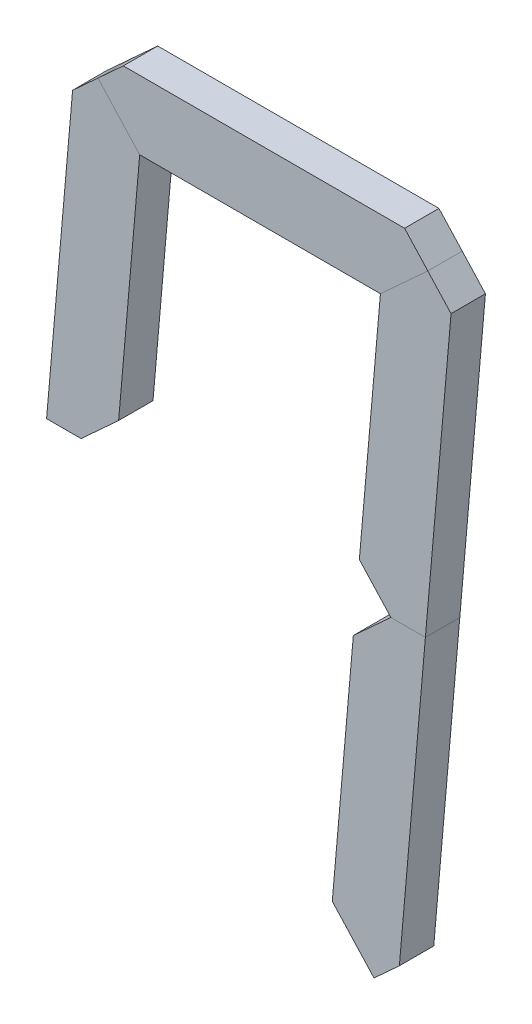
ISO-10303-21;
HEADER;
FILE_DESCRIPTION(('STEP AP214'),'2;1');
FILE_NAME('part.step','',(''),(''),'','','');
FILE_SCHEMA(('AUTOMOTIVE_DESIGN { 1 0 10303 214 1 1 1 1 }'));
ENDSEC;
DATA;
#1=APPLICATION_CONTEXT('core data for automotive mechanical design processes');
#2=APPLICATION_PROTOCOL_DEFINITION('international standard','automotive_design',2000,#1);
#3=PRODUCT_CONTEXT('',#1,'mechanical');
#4=PRODUCT('Part','Part','',(#3));
#5=PRODUCT_RELATED_PRODUCT_CATEGORY('part','',(#4));
#6=PRODUCT_DEFINITION_FORMATION('','',#4);
#7=PRODUCT_DEFINITION_CONTEXT('part definition',#1,'design');
#8=PRODUCT_DEFINITION('design','',#6,#7);
#9=PRODUCT_DEFINITION_SHAPE('','',#8);
#10=(LENGTH_UNIT() NAMED_UNIT(*) SI_UNIT(.MILLI.,.METRE.));
#11=(NAMED_UNIT(*) PLANE_ANGLE_UNIT() SI_UNIT($,.RADIAN.));
#12=(NAMED_UNIT(*) SI_UNIT($,.STERADIAN.) SOLID_ANGLE_UNIT());
#13=UNCERTAINTY_MEASURE_WITH_UNIT(LENGTH_MEASURE(1.E-05),#10,'distance_accuracy_value','');
#14=(GEOMETRIC_REPRESENTATION_CONTEXT(3) GLOBAL_UNCERTAINTY_ASSIGNED_CONTEXT((#13)) GLOBAL_UNIT_ASSIGNED_CONTEXT((#10,
#11,#12)) REPRESENTATION_CONTEXT('',''));
#15=CARTESIAN_POINT('',(0.,0.,0.));
#16=DIRECTION('',(0.,0.,1.));
#17=DIRECTION('',(1.,0.,0.));
#18=AXIS2_PLACEMENT_3D('',#15,#16,#17);
#19=CARTESIAN_POINT('',(2.78896464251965,4.63136133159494,0.));
#20=DIRECTION('',(-0.737277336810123,-0.675590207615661,0.));
#21=DIRECTION('',(0.675590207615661,-0.737277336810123,0.));
#22=AXIS2_PLACEMENT_3D('',#19,#20,#21);
#23=PLANE('',#22);
#24=DIRECTION('',(-0.675590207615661,0.737277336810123,0.));
#25=VECTOR('',#24,1.);
#26=CARTESIAN_POINT('',(2.78896464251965,4.63136133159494,-0.5));
#27=LINE('',#26,#25);
#28=CARTESIAN_POINT('',(2.78896464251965,4.63136133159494,-0.5));
#29=VERTEX_POINT('',#28);
#30=CARTESIAN_POINT('',(2.45116953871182,5.,-0.5));
#31=VERTEX_POINT('',#30);
#32=EDGE_CURVE('E134',#29,#31,#27,.T.);
#33=ORIENTED_EDGE('',*,*,#32,.T.);
#34=DIRECTION('',(0.,0.,-1.));
#35=VECTOR('',#34,1.);
#36=CARTESIAN_POINT('',(2.45116953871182,5.,0.));
#37=LINE('',#36,#35);
#38=CARTESIAN_POINT('',(2.45116953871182,5.,0.));
#39=VERTEX_POINT('',#38);
#40=EDGE_CURVE('E12',#39,#31,#37,.T.);
#41=ORIENTED_EDGE('',*,*,#40,.F.);
#42=DIRECTION('',(-0.675590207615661,0.737277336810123,0.));
#43=VECTOR('',#42,1.);
#44=CARTESIAN_POINT('',(2.78896464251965,4.63136133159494,0.));
#45=LINE('',#44,#43);
#46=CARTESIAN_POINT('',(2.78896464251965,4.63136133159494,0.));
#47=VERTEX_POINT('',#46);
#48=EDGE_CURVE('E144',#47,#39,#45,.T.);
#49=ORIENTED_EDGE('',*,*,#48,.F.);
#50=DIRECTION('',(0.,0.,-1.));
#51=VECTOR('',#50,1.);
#52=CARTESIAN_POINT('',(2.78896464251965,4.63136133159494,0.));
#53=LINE('',#52,#51);
#54=EDGE_CURVE('E130',#47,#29,#53,.T.);
#55=ORIENTED_EDGE('',*,*,#54,.T.);
#56=EDGE_LOOP('',(#33,#41,#49,#55));
#57=FACE_BOUND('',#56,.T.);
#58=ADVANCED_FACE('F50',(#57),#23,.F.);
#59=CARTESIAN_POINT('',(2.45116953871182,5.,0.));
#60=DIRECTION('',(0.,-1.,0.));
#61=DIRECTION('',(0.,0.,1.));
#62=AXIS2_PLACEMENT_3D('',#59,#60,#61);
#63=PLANE('',#62);
#64=DIRECTION('',(-1.,0.,0.));
#65=VECTOR('',#64,1.);
#66=CARTESIAN_POINT('',(2.45116953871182,5.,-0.5));
#67=LINE('',#66,#65);
#68=CARTESIAN_POINT('',(-1.63820566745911,5.,-0.5));
#69=VERTEX_POINT('',#68);
#70=EDGE_CURVE('E137',#31,#69,#67,.T.);
#71=ORIENTED_EDGE('',*,*,#70,.T.);
#72=DIRECTION('',(0.,0.,-1.));
#73=VECTOR('',#72,1.);
#74=CARTESIAN_POINT('',(-1.63820566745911,5.,0.));
#75=LINE('',#74,#73);
#76=CARTESIAN_POINT('',(-1.63820566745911,5.,0.));
#77=VERTEX_POINT('',#76);
#78=EDGE_CURVE('E58',#77,#69,#75,.T.);
#79=ORIENTED_EDGE('',*,*,#78,.F.);
#80=DIRECTION('',(-1.,0.,0.));
#81=VECTOR('',#80,1.);
#82=CARTESIAN_POINT('',(2.45116953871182,5.,0.));
#83=LINE('',#82,#81);
#84=EDGE_CURVE('E103',#39,#77,#83,.T.);
#85=ORIENTED_EDGE('',*,*,#84,.F.);
#86=ORIENTED_EDGE('',*,*,#40,.T.);
#87=EDGE_LOOP('',(#71,#79,#85,#86));
#88=FACE_BOUND('',#87,.T.);
#89=ADVANCED_FACE('F168',(#88),#63,.F.);
#90=CARTESIAN_POINT('',(-1.63820566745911,5.,0.));
#91=DIRECTION('',(0.675590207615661,-0.737277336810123,0.));
#92=DIRECTION('',(0.737277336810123,0.675590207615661,0.));
#93=AXIS2_PLACEMENT_3D('',#90,#91,#92);
#94=PLANE('',#93);
#95=DIRECTION('',(-0.737277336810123,-0.675590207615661,0.));
#96=VECTOR('',#95,1.);
#97=CARTESIAN_POINT('',(-1.63820566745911,5.,-0.5));
#98=LINE('',#97,#96);
#99=CARTESIAN_POINT('',(-2.00684433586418,4.66220489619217,-0.5));
#100=VERTEX_POINT('',#99);
#101=EDGE_CURVE('E139',#69,#100,#98,.T.);
#102=ORIENTED_EDGE('',*,*,#101,.T.);
#103=DIRECTION('',(0.,0.,-1.));
#104=VECTOR('',#103,1.);
#105=CARTESIAN_POINT('',(-2.00684433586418,4.66220489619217,0.));
#106=LINE('',#105,#104);
#107=CARTESIAN_POINT('',(-2.00684433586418,4.66220489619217,0.));
#108=VERTEX_POINT('',#107);
#109=EDGE_CURVE('E125',#108,#100,#106,.T.);
#110=ORIENTED_EDGE('',*,*,#109,.F.);
#111=DIRECTION('',(-0.737277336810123,-0.675590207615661,0.));
#112=VECTOR('',#111,1.);
#113=CARTESIAN_POINT('',(-1.63820566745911,5.,0.));
#114=LINE('',#113,#112);
#115=EDGE_CURVE('E116',#77,#108,#114,.T.);
#116=ORIENTED_EDGE('',*,*,#115,.F.);
#117=ORIENTED_EDGE('',*,*,#78,.T.);
#118=EDGE_LOOP('',(#102,#110,#116,#117));
#119=FACE_BOUND('',#118,.T.);
#120=ADVANCED_FACE('F150',(#119),#94,.F.);
#121=CARTESIAN_POINT('',(-2.00684433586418,4.66220489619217,0.));
#122=DIRECTION('',(0.737277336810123,0.675590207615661,0.));
#123=DIRECTION('',(-0.675590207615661,0.737277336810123,0.));
#124=AXIS2_PLACEMENT_3D('',#121,#122,#123);
#125=PLANE('',#124);
#126=DIRECTION('',(0.675590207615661,-0.737277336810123,0.));
#127=VECTOR('',#126,1.);
#128=CARTESIAN_POINT('',(-2.00684433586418,4.66220489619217,-0.5));
#129=LINE('',#128,#127);
#130=CARTESIAN_POINT('',(-1.40004534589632,4.,-0.5));
#131=VERTEX_POINT('',#130);
#132=EDGE_CURVE('E124',#100,#131,#129,.T.);
#133=ORIENTED_EDGE('',*,*,#132,.T.);
#134=DIRECTION('',(0.,0.,-1.));
#135=VECTOR('',#134,1.);
#136=CARTESIAN_POINT('',(-1.40004534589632,4.,0.));
#137=LINE('',#136,#135);
#138=CARTESIAN_POINT('',(-1.40004534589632,4.,0.));
#139=VERTEX_POINT('',#138);
#140=EDGE_CURVE('E121',#139,#131,#137,.T.);
#141=ORIENTED_EDGE('',*,*,#140,.F.);
#142=DIRECTION('',(0.675590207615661,-0.737277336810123,0.));
#143=VECTOR('',#142,1.);
#144=CARTESIAN_POINT('',(-2.00684433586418,4.66220489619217,0.));
#145=LINE('',#144,#143);
#146=EDGE_CURVE('E110',#108,#139,#145,.T.);
#147=ORIENTED_EDGE('',*,*,#146,.F.);
#148=ORIENTED_EDGE('',*,*,#109,.T.);
#149=EDGE_LOOP('',(#133,#141,#147,#148));
#150=FACE_BOUND('',#149,.T.);
#151=ADVANCED_FACE('F122',(#150),#125,.F.);
#152=CARTESIAN_POINT('',(-1.40004534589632,4.,0.));
#153=DIRECTION('',(0.,1.,0.));
#154=DIRECTION('',(0.,0.,-1.));
#155=AXIS2_PLACEMENT_3D('',#152,#153,#154);
#156=PLANE('',#155);
#157=DIRECTION('',(1.,0.,0.));
#158=VECTOR('',#157,1.);
#159=CARTESIAN_POINT('',(-1.40004534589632,4.,-0.5));
#160=LINE('',#159,#158);
#161=CARTESIAN_POINT('',(2.09995465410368,4.,-0.5));
#162=VERTEX_POINT('',#161);
#163=EDGE_CURVE('E89',#131,#162,#160,.T.);
#164=ORIENTED_EDGE('',*,*,#163,.T.);
#165=DIRECTION('',(0.,0.,-1.));
#166=VECTOR('',#165,1.);
#167=CARTESIAN_POINT('',(2.09995465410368,4.,0.));
#168=LINE('',#167,#166);
#169=CARTESIAN_POINT('',(2.09995465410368,4.,0.));
#170=VERTEX_POINT('',#169);
#171=EDGE_CURVE('E126',#170,#162,#168,.T.);
#172=ORIENTED_EDGE('',*,*,#171,.F.);
#173=DIRECTION('',(1.,0.,0.));
#174=VECTOR('',#173,1.);
#175=CARTESIAN_POINT('',(-1.40004534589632,4.,0.));
#176=LINE('',#175,#174);
#177=EDGE_CURVE('E114',#139,#170,#176,.T.);
#178=ORIENTED_EDGE('',*,*,#177,.F.);
#179=ORIENTED_EDGE('',*,*,#140,.T.);
#180=EDGE_LOOP('',(#164,#172,#178,#179));
#181=FACE_BOUND('',#180,.T.);
#182=ADVANCED_FACE('F128',(#181),#156,.F.);
#183=CARTESIAN_POINT('',(2.09995465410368,4.,0.));
#184=DIRECTION('',(-0.675590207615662,0.737277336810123,0.));
#185=DIRECTION('',(-0.737277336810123,-0.675590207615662,0.));
#186=AXIS2_PLACEMENT_3D('',#183,#184,#185);
#187=PLANE('',#186);
#188=DIRECTION('',(0.737277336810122,0.675590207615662,0.));
#189=VECTOR('',#188,1.);
#190=CARTESIAN_POINT('',(2.09995465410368,4.,-0.5));
#191=LINE('',#190,#189);
#192=EDGE_CURVE('E95',#162,#29,#191,.T.);
#193=ORIENTED_EDGE('',*,*,#192,.T.);
#194=ORIENTED_EDGE('',*,*,#54,.F.);
#195=DIRECTION('',(0.737277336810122,0.675590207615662,0.));
#196=VECTOR('',#195,1.);
#197=CARTESIAN_POINT('',(2.09995465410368,4.,0.));
#198=LINE('',#197,#196);
#199=EDGE_CURVE('E66',#170,#47,#198,.T.);
#200=ORIENTED_EDGE('',*,*,#199,.F.);
#201=ORIENTED_EDGE('',*,*,#171,.T.);
#202=EDGE_LOOP('',(#193,#194,#200,#201));
#203=FACE_BOUND('',#202,.T.);
#204=ADVANCED_FACE('F157',(#203),#187,.F.);
#205=CARTESIAN_POINT('',(0.,0.,0.));
#206=DIRECTION('',(0.,0.,1.));
#207=DIRECTION('',(-1.,0.,0.));
#208=AXIS2_PLACEMENT_3D('',#205,#206,#207);
#209=PLANE('',#208);
#210=ORIENTED_EDGE('',*,*,#48,.T.);
#211=ORIENTED_EDGE('',*,*,#84,.T.);
#212=ORIENTED_EDGE('',*,*,#115,.T.);
#213=ORIENTED_EDGE('',*,*,#146,.T.);
#214=ORIENTED_EDGE('',*,*,#177,.T.);
#215=ORIENTED_EDGE('',*,*,#199,.T.);
#216=EDGE_LOOP('',(#210,#211,#212,#213,#214,#215));
#217=FACE_BOUND('',#216,.T.);
#218=ADVANCED_FACE('F112',(#217),#209,.T.);
#219=CARTESIAN_POINT('',(0.,0.,-0.5));
#220=DIRECTION('',(0.,0.,1.));
#221=DIRECTION('',(-1.,0.,0.));
#222=AXIS2_PLACEMENT_3D('',#219,#220,#221);
#223=PLANE('',#222);
#224=ORIENTED_EDGE('',*,*,#32,.F.);
#225=ORIENTED_EDGE('',*,*,#192,.F.);
#226=ORIENTED_EDGE('',*,*,#163,.F.);
#227=ORIENTED_EDGE('',*,*,#132,.F.);
#228=ORIENTED_EDGE('',*,*,#101,.F.);
#229=ORIENTED_EDGE('',*,*,#70,.F.);
#230=EDGE_LOOP('',(#224,#225,#226,#227,#228,#229));
#231=FACE_BOUND('',#230,.T.);
#232=ADVANCED_FACE('F153',(#231),#223,.F.);
#233=CLOSED_SHELL('',(#58,#89,#120,#151,#182,#204,#218,#232));
#234=MANIFOLD_SOLID_BREP('B2',#233);
#235=CARTESIAN_POINT('',(2.78896464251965,4.63136133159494,0.));
#236=DIRECTION('',(-0.737277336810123,-0.675590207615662,0.));
#237=DIRECTION('',(0.675590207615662,-0.737277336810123,0.));
#238=AXIS2_PLACEMENT_3D('',#235,#236,#237);
#239=PLANE('',#238);
#240=DIRECTION('',(-0.675590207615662,0.737277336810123,0.));
#241=VECTOR('',#240,1.);
#242=CARTESIAN_POINT('',(2.78896464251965,4.63136133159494,-0.5));
#243=LINE('',#242,#241);
#244=CARTESIAN_POINT('',(3.12675974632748,4.26272266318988,-0.5));
#245=VERTEX_POINT('',#244);
#246=CARTESIAN_POINT('',(2.78896464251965,4.63136133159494,-0.5));
#247=VERTEX_POINT('',#246);
#248=EDGE_CURVE('E320',#245,#247,#243,.T.);
#249=ORIENTED_EDGE('',*,*,#248,.T.);
#250=DIRECTION('',(0.,0.,-1.));
#251=VECTOR('',#250,1.);
#252=CARTESIAN_POINT('',(2.78896464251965,4.63136133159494,0.));
#253=LINE('',#252,#251);
#254=CARTESIAN_POINT('',(2.78896464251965,4.63136133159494,0.));
#255=VERTEX_POINT('',#254);
#256=EDGE_CURVE('E48',#255,#247,#253,.T.);
#257=ORIENTED_EDGE('',*,*,#256,.F.);
#258=DIRECTION('',(-0.675590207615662,0.737277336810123,0.));
#259=VECTOR('',#258,1.);
#260=CARTESIAN_POINT('',(2.78896464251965,4.63136133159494,0.));
#261=LINE('',#260,#259);
#262=CARTESIAN_POINT('',(3.12675974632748,4.26272266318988,0.));
#263=VERTEX_POINT('',#262);
#264=EDGE_CURVE('E330',#263,#255,#261,.T.);
#265=ORIENTED_EDGE('',*,*,#264,.F.);
#266=DIRECTION('',(0.,0.,-1.));
#267=VECTOR('',#266,1.);
#268=CARTESIAN_POINT('',(3.12675974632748,4.26272266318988,0.));
#269=LINE('',#268,#267);
#270=EDGE_CURVE('E316',#263,#245,#269,.T.);
#271=ORIENTED_EDGE('',*,*,#270,.T.);
#272=EDGE_LOOP('',(#249,#257,#265,#271));
#273=FACE_BOUND('',#272,.T.);
#274=ADVANCED_FACE('F236',(#273),#239,.F.);
#275=CARTESIAN_POINT('',(2.09995465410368,4.,0.));
#276=DIRECTION('',(0.675590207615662,-0.737277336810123,0.));
#277=DIRECTION('',(0.737277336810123,0.675590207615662,0.));
#278=AXIS2_PLACEMENT_3D('',#275,#276,#277);
#279=PLANE('',#278);
#280=DIRECTION('',(-0.737277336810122,-0.675590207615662,0.));
#281=VECTOR('',#280,1.);
#282=CARTESIAN_POINT('',(2.09995465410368,4.,-0.5));
#283=LINE('',#282,#281);
#284=CARTESIAN_POINT('',(2.09995465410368,4.,-0.5));
#285=VERTEX_POINT('',#284);
#286=EDGE_CURVE('E323',#247,#285,#283,.T.);
#287=ORIENTED_EDGE('',*,*,#286,.T.);
#288=DIRECTION('',(0.,0.,-1.));
#289=VECTOR('',#288,1.);
#290=CARTESIAN_POINT('',(2.09995465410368,4.,0.));
#291=LINE('',#290,#289);
#292=CARTESIAN_POINT('',(2.09995465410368,4.,0.));
#293=VERTEX_POINT('',#292);
#294=EDGE_CURVE('E244',#293,#285,#291,.T.);
#295=ORIENTED_EDGE('',*,*,#294,.F.);
#296=DIRECTION('',(-0.737277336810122,-0.675590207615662,0.));
#297=VECTOR('',#296,1.);
#298=CARTESIAN_POINT('',(2.09995465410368,4.,0.));
#299=LINE('',#298,#297);
#300=EDGE_CURVE('E289',#255,#293,#299,.T.);
#301=ORIENTED_EDGE('',*,*,#300,.F.);
#302=ORIENTED_EDGE('',*,*,#256,.T.);
#303=EDGE_LOOP('',(#287,#295,#301,#302));
#304=FACE_BOUND('',#303,.T.);
#305=ADVANCED_FACE('F354',(#304),#279,.F.);
#306=CARTESIAN_POINT('',(1.79374433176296,0.499999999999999,0.));
#307=DIRECTION('',(0.996194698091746,-0.0871557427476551,0.));
#308=DIRECTION('',(0.0871557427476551,0.996194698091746,0.));
#309=AXIS2_PLACEMENT_3D('',#306,#307,#308);
#310=PLANE('',#309);
#311=DIRECTION('',(-0.0871557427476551,-0.996194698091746,0.));
#312=VECTOR('',#311,1.);
#313=CARTESIAN_POINT('',(1.79374433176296,0.499999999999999,-0.5));
#314=LINE('',#313,#312);
#315=CARTESIAN_POINT('',(1.79374433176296,0.499999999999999,-0.5));
#316=VERTEX_POINT('',#315);
#317=EDGE_CURVE('E325',#285,#316,#314,.T.);
#318=ORIENTED_EDGE('',*,*,#317,.T.);
#319=DIRECTION('',(0.,0.,-1.));
#320=VECTOR('',#319,1.);
#321=CARTESIAN_POINT('',(1.79374433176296,0.499999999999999,0.));
#322=LINE('',#321,#320);
#323=CARTESIAN_POINT('',(1.79374433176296,0.499999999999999,0.));
#324=VERTEX_POINT('',#323);
#325=EDGE_CURVE('E311',#324,#316,#322,.T.);
#326=ORIENTED_EDGE('',*,*,#325,.F.);
#327=DIRECTION('',(-0.0871557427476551,-0.996194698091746,0.));
#328=VECTOR('',#327,1.);
#329=CARTESIAN_POINT('',(1.79374433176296,0.499999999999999,0.));
#330=LINE('',#329,#328);
#331=EDGE_CURVE('E302',#293,#324,#330,.T.);
#332=ORIENTED_EDGE('',*,*,#331,.F.);
#333=ORIENTED_EDGE('',*,*,#294,.T.);
#334=EDGE_LOOP('',(#318,#326,#332,#333));
#335=FACE_BOUND('',#334,.T.);
#336=ADVANCED_FACE('F336',(#335),#310,.F.);
#337=CARTESIAN_POINT('',(2.25190991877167,0.,0.));
#338=DIRECTION('',(0.737277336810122,0.675590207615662,0.));
#339=DIRECTION('',(-0.675590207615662,0.737277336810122,0.));
#340=AXIS2_PLACEMENT_3D('',#337,#338,#339);
#341=PLANE('',#340);
#342=DIRECTION('',(0.675590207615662,-0.737277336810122,0.));
#343=VECTOR('',#342,1.);
#344=CARTESIAN_POINT('',(2.25190991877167,0.,-0.5));
#345=LINE('',#344,#343);
#346=CARTESIAN_POINT('',(2.25190991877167,0.,-0.5));
#347=VERTEX_POINT('',#346);
#348=EDGE_CURVE('E310',#316,#347,#345,.T.);
#349=ORIENTED_EDGE('',*,*,#348,.T.);
#350=DIRECTION('',(0.,0.,-1.));
#351=VECTOR('',#350,1.);
#352=CARTESIAN_POINT('',(2.25190991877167,0.,0.));
#353=LINE('',#352,#351);
#354=CARTESIAN_POINT('',(2.25190991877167,0.,0.));
#355=VERTEX_POINT('',#354);
#356=EDGE_CURVE('E307',#355,#347,#353,.T.);
#357=ORIENTED_EDGE('',*,*,#356,.F.);
#358=DIRECTION('',(0.675590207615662,-0.737277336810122,0.));
#359=VECTOR('',#358,1.);
#360=CARTESIAN_POINT('',(2.25190991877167,0.,0.));
#361=LINE('',#360,#359);
#362=EDGE_CURVE('E296',#324,#355,#361,.T.);
#363=ORIENTED_EDGE('',*,*,#362,.F.);
#364=ORIENTED_EDGE('',*,*,#325,.T.);
#365=EDGE_LOOP('',(#349,#357,#363,#364));
#366=FACE_BOUND('',#365,.T.);
#367=ADVANCED_FACE('F308',(#366),#341,.F.);
#368=CARTESIAN_POINT('',(2.75381983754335,0.,0.));
#369=DIRECTION('',(0.,1.,0.));
#370=DIRECTION('',(-1.,0.,0.));
#371=AXIS2_PLACEMENT_3D('',#368,#369,#370);
#372=PLANE('',#371);
#373=DIRECTION('',(1.,0.,0.));
#374=VECTOR('',#373,1.);
#375=CARTESIAN_POINT('',(2.75381983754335,0.,-0.5));
#376=LINE('',#375,#374);
#377=CARTESIAN_POINT('',(2.75381983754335,0.,-0.5));
#378=VERTEX_POINT('',#377);
#379=EDGE_CURVE('E275',#347,#378,#376,.T.);
#380=ORIENTED_EDGE('',*,*,#379,.T.);
#381=DIRECTION('',(0.,0.,-1.));
#382=VECTOR('',#381,1.);
#383=CARTESIAN_POINT('',(2.75381983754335,0.,0.));
#384=LINE('',#383,#382);
#385=CARTESIAN_POINT('',(2.75381983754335,0.,0.));
#386=VERTEX_POINT('',#385);
#387=EDGE_CURVE('E312',#386,#378,#384,.T.);
#388=ORIENTED_EDGE('',*,*,#387,.F.);
#389=DIRECTION('',(1.,0.,0.));
#390=VECTOR('',#389,1.);
#391=CARTESIAN_POINT('',(2.75381983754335,0.,0.));
#392=LINE('',#391,#390);
#393=EDGE_CURVE('E300',#355,#386,#392,.T.);
#394=ORIENTED_EDGE('',*,*,#393,.F.);
#395=ORIENTED_EDGE('',*,*,#356,.T.);
#396=EDGE_LOOP('',(#380,#388,#394,#395));
#397=FACE_BOUND('',#396,.T.);
#398=ADVANCED_FACE('F314',(#397),#372,.F.);
#399=CARTESIAN_POINT('',(3.12675974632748,4.26272266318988,0.));
#400=DIRECTION('',(-0.996194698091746,0.0871557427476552,0.));
#401=DIRECTION('',(-0.0871557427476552,-0.996194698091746,0.));
#402=AXIS2_PLACEMENT_3D('',#399,#400,#401);
#403=PLANE('',#402);
#404=DIRECTION('',(0.0871557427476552,0.996194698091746,0.));
#405=VECTOR('',#404,1.);
#406=CARTESIAN_POINT('',(3.12675974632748,4.26272266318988,-0.5));
#407=LINE('',#406,#405);
#408=EDGE_CURVE('E281',#378,#245,#407,.T.);
#409=ORIENTED_EDGE('',*,*,#408,.T.);
#410=ORIENTED_EDGE('',*,*,#270,.F.);
#411=DIRECTION('',(0.0871557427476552,0.996194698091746,0.));
#412=VECTOR('',#411,1.);
#413=CARTESIAN_POINT('',(3.12675974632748,4.26272266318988,0.));
#414=LINE('',#413,#412);
#415=EDGE_CURVE('E252',#386,#263,#414,.T.);
#416=ORIENTED_EDGE('',*,*,#415,.F.);
#417=ORIENTED_EDGE('',*,*,#387,.T.);
#418=EDGE_LOOP('',(#409,#410,#416,#417));
#419=FACE_BOUND('',#418,.T.);
#420=ADVANCED_FACE('F343',(#419),#403,.F.);
#421=CARTESIAN_POINT('',(0.,0.,0.));
#422=DIRECTION('',(0.,0.,1.));
#423=DIRECTION('',(-1.,0.,0.));
#424=AXIS2_PLACEMENT_3D('',#421,#422,#423);
#425=PLANE('',#424);
#426=ORIENTED_EDGE('',*,*,#264,.T.);
#427=ORIENTED_EDGE('',*,*,#300,.T.);
#428=ORIENTED_EDGE('',*,*,#331,.T.);
#429=ORIENTED_EDGE('',*,*,#362,.T.);
#430=ORIENTED_EDGE('',*,*,#393,.T.);
#431=ORIENTED_EDGE('',*,*,#415,.T.);
#432=EDGE_LOOP('',(#426,#427,#428,#429,#430,#431));
#433=FACE_BOUND('',#432,.T.);
#434=ADVANCED_FACE('F298',(#433),#425,.T.);
#435=CARTESIAN_POINT('',(0.,0.,-0.5));
#436=DIRECTION('',(0.,0.,1.));
#437=DIRECTION('',(-1.,0.,0.));
#438=AXIS2_PLACEMENT_3D('',#435,#436,#437);
#439=PLANE('',#438);
#440=ORIENTED_EDGE('',*,*,#248,.F.);
#441=ORIENTED_EDGE('',*,*,#408,.F.);
#442=ORIENTED_EDGE('',*,*,#379,.F.);
#443=ORIENTED_EDGE('',*,*,#348,.F.);
#444=ORIENTED_EDGE('',*,*,#317,.F.);
#445=ORIENTED_EDGE('',*,*,#286,.F.);
#446=EDGE_LOOP('',(#440,#441,#442,#443,#444,#445));
#447=FACE_BOUND('',#446,.T.);
#448=ADVANCED_FACE('F339',(#447),#439,.F.);
#449=CLOSED_SHELL('',(#274,#305,#336,#367,#398,#420,#434,#448));
#450=MANIFOLD_SOLID_BREP('B6',#449);
#451=CARTESIAN_POINT('',(-2.00684433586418,4.66220489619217,0.));
#452=DIRECTION('',(-0.737277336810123,-0.675590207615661,0.));
#453=DIRECTION('',(0.675590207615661,-0.737277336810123,0.));
#454=AXIS2_PLACEMENT_3D('',#451,#452,#453);
#455=PLANE('',#454);
#456=DIRECTION('',(-0.675590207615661,0.737277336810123,0.));
#457=VECTOR('',#456,1.);
#458=CARTESIAN_POINT('',(-2.00684433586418,4.66220489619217,-0.5));
#459=LINE('',#458,#457);
#460=CARTESIAN_POINT('',(-1.40004534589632,4.,-0.5));
#461=VERTEX_POINT('',#460);
#462=CARTESIAN_POINT('',(-2.00684433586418,4.66220489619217,-0.5));
#463=VERTEX_POINT('',#462);
#464=EDGE_CURVE('E505',#461,#463,#459,.T.);
#465=ORIENTED_EDGE('',*,*,#464,.T.);
#466=DIRECTION('',(0.,0.,-1.));
#467=VECTOR('',#466,1.);
#468=CARTESIAN_POINT('',(-2.00684433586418,4.66220489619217,0.));
#469=LINE('',#468,#467);
#470=CARTESIAN_POINT('',(-2.00684433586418,4.66220489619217,0.));
#471=VERTEX_POINT('',#470);
#472=EDGE_CURVE('E234',#471,#463,#469,.T.);
#473=ORIENTED_EDGE('',*,*,#472,.F.);
#474=DIRECTION('',(-0.675590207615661,0.737277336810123,0.));
#475=VECTOR('',#474,1.);
#476=CARTESIAN_POINT('',(-2.00684433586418,4.66220489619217,0.));
#477=LINE('',#476,#475);
#478=CARTESIAN_POINT('',(-1.40004534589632,4.,0.));
#479=VERTEX_POINT('',#478);
#480=EDGE_CURVE('E515',#479,#471,#477,.T.);
#481=ORIENTED_EDGE('',*,*,#480,.F.);
#482=DIRECTION('',(0.,0.,-1.));
#483=VECTOR('',#482,1.);
#484=CARTESIAN_POINT('',(-1.40004534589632,4.,0.));
#485=LINE('',#484,#483);
#486=EDGE_CURVE('E501',#479,#461,#485,.T.);
#487=ORIENTED_EDGE('',*,*,#486,.T.);
#488=EDGE_LOOP('',(#465,#473,#481,#487));
#489=FACE_BOUND('',#488,.T.);
#490=ADVANCED_FACE('F421',(#489),#455,.F.);
#491=CARTESIAN_POINT('',(-2.37548300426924,4.32440979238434,0.));
#492=DIRECTION('',(0.675590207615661,-0.737277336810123,0.));
#493=DIRECTION('',(0.737277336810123,0.675590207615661,0.));
#494=AXIS2_PLACEMENT_3D('',#491,#492,#493);
#495=PLANE('',#494);
#496=DIRECTION('',(-0.737277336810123,-0.675590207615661,0.));
#497=VECTOR('',#496,1.);
#498=CARTESIAN_POINT('',(-2.37548300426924,4.32440979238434,-0.5));
#499=LINE('',#498,#497);
#500=CARTESIAN_POINT('',(-2.37548300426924,4.32440979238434,-0.5));
#501=VERTEX_POINT('',#500);
#502=EDGE_CURVE('E508',#463,#501,#499,.T.);
#503=ORIENTED_EDGE('',*,*,#502,.T.);
#504=DIRECTION('',(0.,0.,-1.));
#505=VECTOR('',#504,1.);
#506=CARTESIAN_POINT('',(-2.37548300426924,4.32440979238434,0.));
#507=LINE('',#506,#505);
#508=CARTESIAN_POINT('',(-2.37548300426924,4.32440979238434,0.));
#509=VERTEX_POINT('',#508);
#510=EDGE_CURVE('E429',#509,#501,#507,.T.);
#511=ORIENTED_EDGE('',*,*,#510,.F.);
#512=DIRECTION('',(-0.737277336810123,-0.675590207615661,0.));
#513=VECTOR('',#512,1.);
#514=CARTESIAN_POINT('',(-2.37548300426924,4.32440979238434,0.));
#515=LINE('',#514,#513);
#516=EDGE_CURVE('E474',#471,#509,#515,.T.);
#517=ORIENTED_EDGE('',*,*,#516,.F.);
#518=ORIENTED_EDGE('',*,*,#472,.T.);
#519=EDGE_LOOP('',(#503,#511,#517,#518));
#520=FACE_BOUND('',#519,.T.);
#521=ADVANCED_FACE('F539',(#520),#495,.F.);
#522=CARTESIAN_POINT('',(-2.75381983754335,0.,0.));
#523=DIRECTION('',(0.996194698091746,-0.087155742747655,0.));
#524=DIRECTION('',(0.087155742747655,0.996194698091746,0.));
#525=AXIS2_PLACEMENT_3D('',#522,#523,#524);
#526=PLANE('',#525);
#527=DIRECTION('',(-0.087155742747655,-0.996194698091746,0.));
#528=VECTOR('',#527,1.);
#529=CARTESIAN_POINT('',(-2.75381983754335,0.,-0.5));
#530=LINE('',#529,#528);
#531=CARTESIAN_POINT('',(-2.75381983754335,0.,-0.5));
#532=VERTEX_POINT('',#531);
#533=EDGE_CURVE('E510',#501,#532,#530,.T.);
#534=ORIENTED_EDGE('',*,*,#533,.T.);
#535=DIRECTION('',(0.,0.,-1.));
#536=VECTOR('',#535,1.);
#537=CARTESIAN_POINT('',(-2.75381983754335,0.,0.));
#538=LINE('',#537,#536);
#539=CARTESIAN_POINT('',(-2.75381983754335,0.,0.));
#540=VERTEX_POINT('',#539);
#541=EDGE_CURVE('E496',#540,#532,#538,.T.);
#542=ORIENTED_EDGE('',*,*,#541,.F.);
#543=DIRECTION('',(-0.087155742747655,-0.996194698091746,0.));
#544=VECTOR('',#543,1.);
#545=CARTESIAN_POINT('',(-2.75381983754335,0.,0.));
#546=LINE('',#545,#544);
#547=EDGE_CURVE('E487',#509,#540,#546,.T.);
#548=ORIENTED_EDGE('',*,*,#547,.F.);
#549=ORIENTED_EDGE('',*,*,#510,.T.);
#550=EDGE_LOOP('',(#534,#542,#548,#549));
#551=FACE_BOUND('',#550,.T.);
#552=ADVANCED_FACE('F521',(#551),#526,.F.);
#553=CARTESIAN_POINT('',(-2.25190991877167,0.,0.));
#554=DIRECTION('',(0.,1.,0.));
#555=DIRECTION('',(-1.,0.,0.));
#556=AXIS2_PLACEMENT_3D('',#553,#554,#555);
#557=PLANE('',#556);
#558=DIRECTION('',(1.,0.,0.));
#559=VECTOR('',#558,1.);
#560=CARTESIAN_POINT('',(-2.25190991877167,0.,-0.5));
#561=LINE('',#560,#559);
#562=CARTESIAN_POINT('',(-2.25190991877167,0.,-0.5));
#563=VERTEX_POINT('',#562);
#564=EDGE_CURVE('E495',#532,#563,#561,.T.);
#565=ORIENTED_EDGE('',*,*,#564,.T.);
#566=DIRECTION('',(0.,0.,-1.));
#567=VECTOR('',#566,1.);
#568=CARTESIAN_POINT('',(-2.25190991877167,0.,0.));
#569=LINE('',#568,#567);
#570=CARTESIAN_POINT('',(-2.25190991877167,0.,0.));
#571=VERTEX_POINT('',#570);
#572=EDGE_CURVE('E492',#571,#563,#569,.T.);
#573=ORIENTED_EDGE('',*,*,#572,.F.);
#574=DIRECTION('',(1.,0.,0.));
#575=VECTOR('',#574,1.);
#576=CARTESIAN_POINT('',(-2.25190991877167,0.,0.));
#577=LINE('',#576,#575);
#578=EDGE_CURVE('E481',#540,#571,#577,.T.);
#579=ORIENTED_EDGE('',*,*,#578,.F.);
#580=ORIENTED_EDGE('',*,*,#541,.T.);
#581=EDGE_LOOP('',(#565,#573,#579,#580));
#582=FACE_BOUND('',#581,.T.);
#583=ADVANCED_FACE('F493',(#582),#557,.F.);
#584=CARTESIAN_POINT('',(-1.70625566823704,0.499999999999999,0.));
#585=DIRECTION('',(-0.675590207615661,0.737277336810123,0.));
#586=DIRECTION('',(-0.737277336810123,-0.675590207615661,0.));
#587=AXIS2_PLACEMENT_3D('',#584,#585,#586);
#588=PLANE('',#587);
#589=DIRECTION('',(0.737277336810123,0.675590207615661,0.));
#590=VECTOR('',#589,1.);
#591=CARTESIAN_POINT('',(-1.70625566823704,0.499999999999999,-0.5));
#592=LINE('',#591,#590);
#593=CARTESIAN_POINT('',(-1.70625566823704,0.499999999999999,-0.5));
#594=VERTEX_POINT('',#593);
#595=EDGE_CURVE('E460',#563,#594,#592,.T.);
#596=ORIENTED_EDGE('',*,*,#595,.T.);
#597=DIRECTION('',(0.,0.,-1.));
#598=VECTOR('',#597,1.);
#599=CARTESIAN_POINT('',(-1.70625566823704,0.499999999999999,0.));
#600=LINE('',#599,#598);
#601=CARTESIAN_POINT('',(-1.70625566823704,0.499999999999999,0.));
#602=VERTEX_POINT('',#601);
#603=EDGE_CURVE('E497',#602,#594,#600,.T.);
#604=ORIENTED_EDGE('',*,*,#603,.F.);
#605=DIRECTION('',(0.737277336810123,0.675590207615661,0.));
#606=VECTOR('',#605,1.);
#607=CARTESIAN_POINT('',(-1.70625566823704,0.499999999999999,0.));
#608=LINE('',#607,#606);
#609=EDGE_CURVE('E485',#571,#602,#608,.T.);
#610=ORIENTED_EDGE('',*,*,#609,.F.);
#611=ORIENTED_EDGE('',*,*,#572,.T.);
#612=EDGE_LOOP('',(#596,#604,#610,#611));
#613=FACE_BOUND('',#612,.T.);
#614=ADVANCED_FACE('F499',(#613),#588,.F.);
#615=CARTESIAN_POINT('',(-1.40004534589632,4.,0.));
#616=DIRECTION('',(-0.996194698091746,0.0871557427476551,0.));
#617=DIRECTION('',(-0.0871557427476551,-0.996194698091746,0.));
#618=AXIS2_PLACEMENT_3D('',#615,#616,#617);
#619=PLANE('',#618);
#620=DIRECTION('',(0.0871557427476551,0.996194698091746,0.));
#621=VECTOR('',#620,1.);
#622=CARTESIAN_POINT('',(-1.40004534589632,4.,-0.5));
#623=LINE('',#622,#621);
#624=EDGE_CURVE('E466',#594,#461,#623,.T.);
#625=ORIENTED_EDGE('',*,*,#624,.T.);
#626=ORIENTED_EDGE('',*,*,#486,.F.);
#627=DIRECTION('',(0.0871557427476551,0.996194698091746,0.));
#628=VECTOR('',#627,1.);
#629=CARTESIAN_POINT('',(-1.40004534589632,4.,0.));
#630=LINE('',#629,#628);
#631=EDGE_CURVE('E437',#602,#479,#630,.T.);
#632=ORIENTED_EDGE('',*,*,#631,.F.);
#633=ORIENTED_EDGE('',*,*,#603,.T.);
#634=EDGE_LOOP('',(#625,#626,#632,#633));
#635=FACE_BOUND('',#634,.T.);
#636=ADVANCED_FACE('F528',(#635),#619,.F.);
#637=CARTESIAN_POINT('',(0.,0.,0.));
#638=DIRECTION('',(0.,0.,-1.));
#639=DIRECTION('',(1.,0.,0.));
#640=AXIS2_PLACEMENT_3D('',#637,#638,#639);
#641=PLANE('',#640);
#642=ORIENTED_EDGE('',*,*,#480,.T.);
#643=ORIENTED_EDGE('',*,*,#516,.T.);
#644=ORIENTED_EDGE('',*,*,#547,.T.);
#645=ORIENTED_EDGE('',*,*,#578,.T.);
#646=ORIENTED_EDGE('',*,*,#609,.T.);
#647=ORIENTED_EDGE('',*,*,#631,.T.);
#648=EDGE_LOOP('',(#642,#643,#644,#645,#646,#647));
#649=FACE_BOUND('',#648,.T.);
#650=ADVANCED_FACE('F483',(#649),#641,.F.);
#651=CARTESIAN_POINT('',(0.,0.,-0.5));
#652=DIRECTION('',(0.,0.,-1.));
#653=DIRECTION('',(1.,0.,0.));
#654=AXIS2_PLACEMENT_3D('',#651,#652,#653);
#655=PLANE('',#654);
#656=ORIENTED_EDGE('',*,*,#464,.F.);
#657=ORIENTED_EDGE('',*,*,#624,.F.);
#658=ORIENTED_EDGE('',*,*,#595,.F.);
#659=ORIENTED_EDGE('',*,*,#564,.F.);
#660=ORIENTED_EDGE('',*,*,#533,.F.);
#661=ORIENTED_EDGE('',*,*,#502,.F.);
#662=EDGE_LOOP('',(#656,#657,#658,#659,#660,#661));
#663=FACE_BOUND('',#662,.T.);
#664=ADVANCED_FACE('F524',(#663),#655,.T.);
#665=CLOSED_SHELL('',(#490,#521,#552,#583,#614,#636,#650,#664));
#666=MANIFOLD_SOLID_BREP('B42',#665);
#667=CARTESIAN_POINT('',(2.00684433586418,-4.66220489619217,0.));
#668=DIRECTION('',(0.737277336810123,0.675590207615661,0.));
#669=DIRECTION('',(-0.675590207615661,0.737277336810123,0.));
#670=AXIS2_PLACEMENT_3D('',#667,#668,#669);
#671=PLANE('',#670);
#672=DIRECTION('',(0.675590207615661,-0.737277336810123,0.));
#673=VECTOR('',#672,1.);
#674=CARTESIAN_POINT('',(2.00684433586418,-4.66220489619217,-0.5));
#675=LINE('',#674,#673);
#676=CARTESIAN_POINT('',(1.40004534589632,-4.,-0.5));
#677=VERTEX_POINT('',#676);
#678=CARTESIAN_POINT('',(2.00684433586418,-4.66220489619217,-0.5));
#679=VERTEX_POINT('',#678);
#680=EDGE_CURVE('E697',#677,#679,#675,.T.);
#681=ORIENTED_EDGE('',*,*,#680,.T.);
#682=DIRECTION('',(0.,0.,-1.));
#683=VECTOR('',#682,1.);
#684=CARTESIAN_POINT('',(2.00684433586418,-4.66220489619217,0.));
#685=LINE('',#684,#683);
#686=CARTESIAN_POINT('',(2.00684433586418,-4.66220489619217,0.));
#687=VERTEX_POINT('',#686);
#688=EDGE_CURVE('E419',#687,#679,#685,.T.);
#689=ORIENTED_EDGE('',*,*,#688,.F.);
#690=DIRECTION('',(0.675590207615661,-0.737277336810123,0.));
#691=VECTOR('',#690,1.);
#692=CARTESIAN_POINT('',(2.00684433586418,-4.66220489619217,0.));
#693=LINE('',#692,#691);
#694=CARTESIAN_POINT('',(1.40004534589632,-4.,0.));
#695=VERTEX_POINT('',#694);
#696=EDGE_CURVE('E712',#695,#687,#693,.T.);
#697=ORIENTED_EDGE('',*,*,#696,.F.);
#698=DIRECTION('',(0.,0.,-1.));
#699=VECTOR('',#698,1.);
#700=CARTESIAN_POINT('',(1.40004534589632,-4.,0.));
#701=LINE('',#700,#699);
#702=EDGE_CURVE('E693',#695,#677,#701,.T.);
#703=ORIENTED_EDGE('',*,*,#702,.T.);
#704=EDGE_LOOP('',(#681,#689,#697,#703));
#705=FACE_BOUND('',#704,.T.);
#706=ADVANCED_FACE('F597',(#705),#671,.F.);
#707=CARTESIAN_POINT('',(2.37548300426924,-4.32440979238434,0.));
#708=DIRECTION('',(-0.675590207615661,0.737277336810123,0.));
#709=DIRECTION('',(-0.737277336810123,-0.675590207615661,0.));
#710=AXIS2_PLACEMENT_3D('',#707,#708,#709);
#711=PLANE('',#710);
#712=DIRECTION('',(0.737277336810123,0.675590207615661,0.));
#713=VECTOR('',#712,1.);
#714=CARTESIAN_POINT('',(2.37548300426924,-4.32440979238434,-0.5));
#715=LINE('',#714,#713);
#716=CARTESIAN_POINT('',(2.37548300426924,-4.32440979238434,-0.5));
#717=VERTEX_POINT('',#716);
#718=EDGE_CURVE('E701',#679,#717,#715,.T.);
#719=ORIENTED_EDGE('',*,*,#718,.T.);
#720=DIRECTION('',(0.,0.,-1.));
#721=VECTOR('',#720,1.);
#722=CARTESIAN_POINT('',(2.37548300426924,-4.32440979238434,0.));
#723=LINE('',#722,#721);
#724=CARTESIAN_POINT('',(2.37548300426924,-4.32440979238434,0.));
#725=VERTEX_POINT('',#724);
#726=EDGE_CURVE('E606',#725,#717,#723,.T.);
#727=ORIENTED_EDGE('',*,*,#726,.F.);
#728=DIRECTION('',(0.737277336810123,0.675590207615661,0.));
#729=VECTOR('',#728,1.);
#730=CARTESIAN_POINT('',(2.37548300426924,-4.32440979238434,0.));
#731=LINE('',#730,#729);
#732=EDGE_CURVE('E659',#687,#725,#731,.T.);
#733=ORIENTED_EDGE('',*,*,#732,.F.);
#734=ORIENTED_EDGE('',*,*,#688,.T.);
#735=EDGE_LOOP('',(#719,#727,#733,#734));
#736=FACE_BOUND('',#735,.T.);
#737=ADVANCED_FACE('F740',(#736),#711,.F.);
#738=CARTESIAN_POINT('',(2.75381983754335,0.,0.));
#739=DIRECTION('',(-0.996194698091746,0.087155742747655,0.));
#740=DIRECTION('',(-0.087155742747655,-0.996194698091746,0.));
#741=AXIS2_PLACEMENT_3D('',#738,#739,#740);
#742=PLANE('',#741);
#743=DIRECTION('',(0.087155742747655,0.996194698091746,0.));
#744=VECTOR('',#743,1.);
#745=CARTESIAN_POINT('',(2.75381983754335,0.,-0.5));
#746=LINE('',#745,#744);
#747=CARTESIAN_POINT('',(2.75381983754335,0.,-0.5));
#748=VERTEX_POINT('',#747);
#749=EDGE_CURVE('E704',#717,#748,#746,.T.);
#750=ORIENTED_EDGE('',*,*,#749,.T.);
#751=DIRECTION('',(0.,0.,-1.));
#752=VECTOR('',#751,1.);
#753=CARTESIAN_POINT('',(2.75381983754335,0.,0.));
#754=LINE('',#753,#752);
#755=CARTESIAN_POINT('',(2.75381983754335,0.,0.));
#756=VERTEX_POINT('',#755);
#757=EDGE_CURVE('E685',#756,#748,#754,.T.);
#758=ORIENTED_EDGE('',*,*,#757,.F.);
#759=DIRECTION('',(0.087155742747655,0.996194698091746,0.));
#760=VECTOR('',#759,1.);
#761=CARTESIAN_POINT('',(2.75381983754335,0.,0.));
#762=LINE('',#761,#760);
#763=EDGE_CURVE('E674',#725,#756,#762,.T.);
#764=ORIENTED_EDGE('',*,*,#763,.F.);
#765=ORIENTED_EDGE('',*,*,#726,.T.);
#766=EDGE_LOOP('',(#750,#758,#764,#765));
#767=FACE_BOUND('',#766,.T.);
#768=ADVANCED_FACE('F722',(#767),#742,.F.);
#769=CARTESIAN_POINT('',(2.25190991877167,0.,0.));
#770=DIRECTION('',(0.,-1.,0.));
#771=DIRECTION('',(1.,0.,0.));
#772=AXIS2_PLACEMENT_3D('',#769,#770,#771);
#773=PLANE('',#772);
#774=DIRECTION('',(-1.,0.,0.));
#775=VECTOR('',#774,1.);
#776=CARTESIAN_POINT('',(2.25190991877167,0.,-0.5));
#777=LINE('',#776,#775);
#778=CARTESIAN_POINT('',(2.25190991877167,0.,-0.5));
#779=VERTEX_POINT('',#778);
#780=EDGE_CURVE('E683',#748,#779,#777,.T.);
#781=ORIENTED_EDGE('',*,*,#780,.T.);
#782=DIRECTION('',(0.,0.,-1.));
#783=VECTOR('',#782,1.);
#784=CARTESIAN_POINT('',(2.25190991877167,0.,0.));
#785=LINE('',#784,#783);
#786=CARTESIAN_POINT('',(2.25190991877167,0.,0.));
#787=VERTEX_POINT('',#786);
#788=EDGE_CURVE('E680',#787,#779,#785,.T.);
#789=ORIENTED_EDGE('',*,*,#788,.F.);
#790=DIRECTION('',(-1.,0.,0.));
#791=VECTOR('',#790,1.);
#792=CARTESIAN_POINT('',(2.25190991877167,0.,0.));
#793=LINE('',#792,#791);
#794=EDGE_CURVE('E668',#756,#787,#793,.T.);
#795=ORIENTED_EDGE('',*,*,#794,.F.);
#796=ORIENTED_EDGE('',*,*,#757,.T.);
#797=EDGE_LOOP('',(#781,#789,#795,#796));
#798=FACE_BOUND('',#797,.T.);
#799=ADVANCED_FACE('F681',(#798),#773,.F.);
#800=CARTESIAN_POINT('',(1.70625566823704,-0.499999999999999,0.));
#801=DIRECTION('',(0.675590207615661,-0.737277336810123,0.));
#802=DIRECTION('',(0.737277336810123,0.675590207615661,0.));
#803=AXIS2_PLACEMENT_3D('',#800,#801,#802);
#804=PLANE('',#803);
#805=DIRECTION('',(-0.737277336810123,-0.675590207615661,0.));
#806=VECTOR('',#805,1.);
#807=CARTESIAN_POINT('',(1.70625566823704,-0.499999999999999,-0.5));
#808=LINE('',#807,#806);
#809=CARTESIAN_POINT('',(1.70625566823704,-0.499999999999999,-0.5));
#810=VERTEX_POINT('',#809);
#811=EDGE_CURVE('E643',#779,#810,#808,.T.);
#812=ORIENTED_EDGE('',*,*,#811,.T.);
#813=DIRECTION('',(0.,0.,-1.));
#814=VECTOR('',#813,1.);
#815=CARTESIAN_POINT('',(1.70625566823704,-0.499999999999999,0.));
#816=LINE('',#815,#814);
#817=CARTESIAN_POINT('',(1.70625566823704,-0.499999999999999,0.));
#818=VERTEX_POINT('',#817);
#819=EDGE_CURVE('E686',#818,#810,#816,.T.);
#820=ORIENTED_EDGE('',*,*,#819,.F.);
#821=DIRECTION('',(-0.737277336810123,-0.675590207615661,0.));
#822=VECTOR('',#821,1.);
#823=CARTESIAN_POINT('',(1.70625566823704,-0.499999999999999,0.));
#824=LINE('',#823,#822);
#825=EDGE_CURVE('E672',#787,#818,#824,.T.);
#826=ORIENTED_EDGE('',*,*,#825,.F.);
#827=ORIENTED_EDGE('',*,*,#788,.T.);
#828=EDGE_LOOP('',(#812,#820,#826,#827));
#829=FACE_BOUND('',#828,.T.);
#830=ADVANCED_FACE('F688',(#829),#804,.F.);
#831=CARTESIAN_POINT('',(1.40004534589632,-4.,0.));
#832=DIRECTION('',(0.996194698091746,-0.0871557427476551,0.));
#833=DIRECTION('',(0.0871557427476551,0.996194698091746,0.));
#834=AXIS2_PLACEMENT_3D('',#831,#832,#833);
#835=PLANE('',#834);
#836=DIRECTION('',(-0.0871557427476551,-0.996194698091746,0.));
#837=VECTOR('',#836,1.);
#838=CARTESIAN_POINT('',(1.40004534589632,-4.,-0.5));
#839=LINE('',#838,#837);
#840=EDGE_CURVE('E651',#810,#677,#839,.T.);
#841=ORIENTED_EDGE('',*,*,#840,.T.);
#842=ORIENTED_EDGE('',*,*,#702,.F.);
#843=DIRECTION('',(-0.0871557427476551,-0.996194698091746,0.));
#844=VECTOR('',#843,1.);
#845=CARTESIAN_POINT('',(1.40004534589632,-4.,0.));
#846=LINE('',#845,#844);
#847=EDGE_CURVE('E617',#818,#695,#846,.T.);
#848=ORIENTED_EDGE('',*,*,#847,.F.);
#849=ORIENTED_EDGE('',*,*,#819,.T.);
#850=EDGE_LOOP('',(#841,#842,#848,#849));
#851=FACE_BOUND('',#850,.T.);
#852=ADVANCED_FACE('F729',(#851),#835,.F.);
#853=CARTESIAN_POINT('',(0.,0.,0.));
#854=DIRECTION('',(0.,0.,-1.));
#855=DIRECTION('',(-1.,0.,0.));
#856=AXIS2_PLACEMENT_3D('',#853,#854,#855);
#857=PLANE('',#856);
#858=ORIENTED_EDGE('',*,*,#696,.T.);
#859=ORIENTED_EDGE('',*,*,#732,.T.);
#860=ORIENTED_EDGE('',*,*,#763,.T.);
#861=ORIENTED_EDGE('',*,*,#794,.T.);
#862=ORIENTED_EDGE('',*,*,#825,.T.);
#863=ORIENTED_EDGE('',*,*,#847,.T.);
#864=EDGE_LOOP('',(#858,#859,#860,#861,#862,#863));
#865=FACE_BOUND('',#864,.T.);
#866=ADVANCED_FACE('F670',(#865),#857,.F.);
#867=CARTESIAN_POINT('',(0.,0.,-0.5));
#868=DIRECTION('',(0.,0.,-1.));
#869=DIRECTION('',(-1.,0.,0.));
#870=AXIS2_PLACEMENT_3D('',#867,#868,#869);
#871=PLANE('',#870);
#872=ORIENTED_EDGE('',*,*,#680,.F.);
#873=ORIENTED_EDGE('',*,*,#840,.F.);
#874=ORIENTED_EDGE('',*,*,#811,.F.);
#875=ORIENTED_EDGE('',*,*,#780,.F.);
#876=ORIENTED_EDGE('',*,*,#749,.F.);
#877=ORIENTED_EDGE('',*,*,#718,.F.);
#878=EDGE_LOOP('',(#872,#873,#874,#875,#876,#877));
#879=FACE_BOUND('',#878,.T.);
#880=ADVANCED_FACE('F725',(#879),#871,.T.);
#881=CLOSED_SHELL('',(#706,#737,#768,#799,#830,#852,#866,#880));
#882=MANIFOLD_SOLID_BREP('B228',#881);
#883=ADVANCED_BREP_SHAPE_REPRESENTATION('',(#18,#234,#450,#666,#882),#14);
#884=SHAPE_DEFINITION_REPRESENTATION(#9,#883);
ENDSEC;
END-ISO-10303-21;
